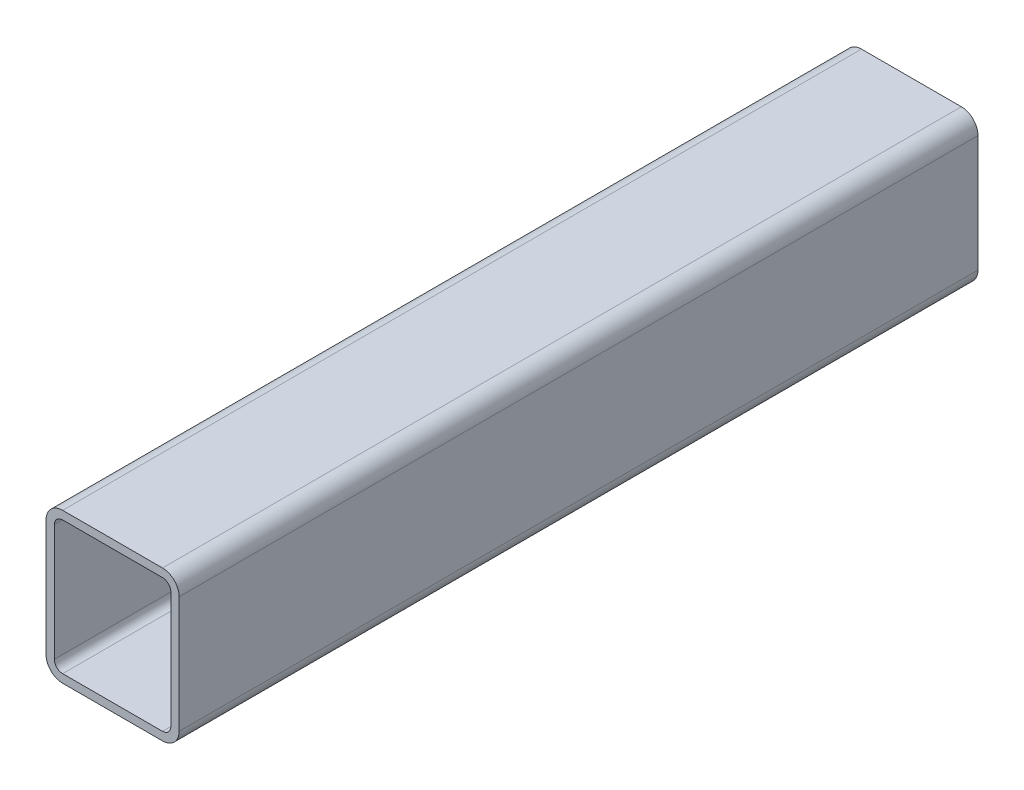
from build123d import *

# Parameters (mm, degrees)
BOSS_EXTRUDE1_DEPTH = 304.8


with BuildPart() as part:
    # Sketch1 → Boss-Extrude1 (new body)
    with BuildSketch(Plane.XY):
        with BuildLine():
            Line((6.35, 57.15), (44.45, 57.15))
            ThreePointArc((44.45, 57.15), (48.940128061, 55.290128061), (50.8, 50.8))
            Line((50.8, 50.8), (50.8, 6.35))
            ThreePointArc((50.8, 6.35), (48.940128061, 1.859871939), (44.45, 0))
            Line((44.45, 0), (6.35, 0))
            ThreePointArc((6.35, 0), (1.859871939, 1.859871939), (0, 6.35))
            Line((0, 6.35), (0, 50.8))
            ThreePointArc((0, 50.8), (1.859871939, 55.290128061), (6.35, 57.15))
        make_face()
        with BuildLine():
            Line((6.35, 53.975), (44.45, 53.975))
            ThreePointArc((44.45, 53.975), (46.69506403, 53.04506403), (47.625, 50.8))
            Line((47.625, 50.8), (47.625, 6.35))
            ThreePointArc((47.625, 6.35), (46.69506403, 4.10493597), (44.45, 3.175))
            Line((44.45, 3.175), (6.35, 3.175))
            ThreePointArc((6.35, 3.175), (4.10493597, 4.10493597), (3.175, 6.35))
            Line((3.175, 6.35), (3.175, 50.8))
            ThreePointArc((3.175, 50.8), (4.10493597, 53.04506403), (6.35, 53.975))
        make_face(mode=Mode.SUBTRACT)
    extrude(amount=BOSS_EXTRUDE1_DEPTH)


solid = part.part
